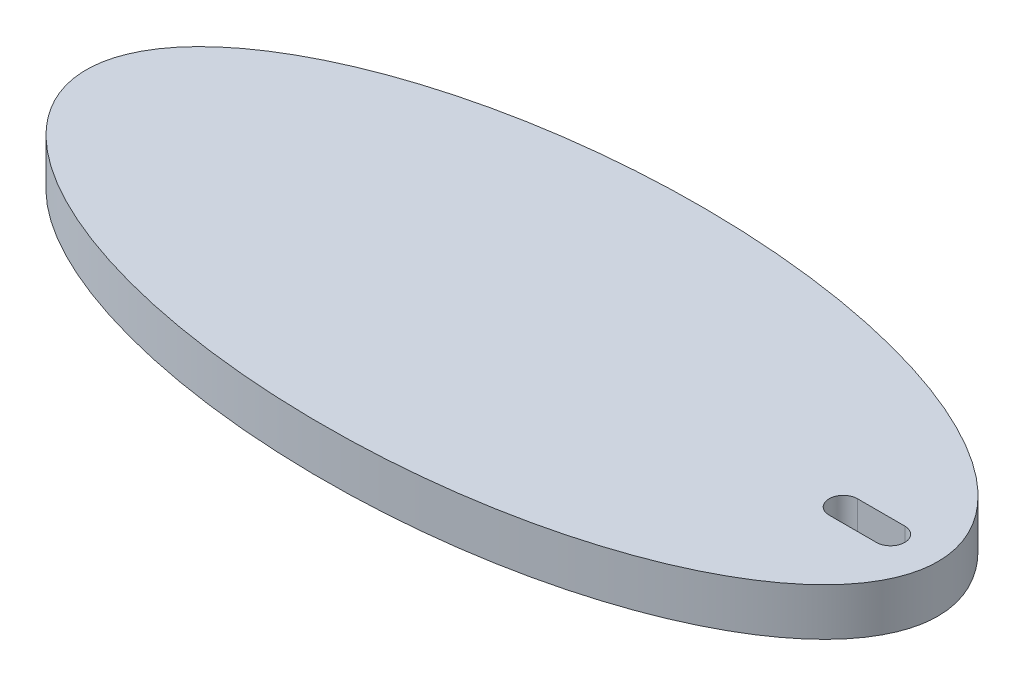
from build123d import *

# Parameters (mm, degrees)
SKETCH1_RX         = 45
SKETCH1_RY         = 20
EXTRUDE1_DEPTH     = 5
CUT_EXTRUDE1_DEPTH = 5


with BuildPart() as part:
    # Sketch1 → Extrude1 (new body)
    with BuildSketch(Plane(origin=(0, 0, 0), x_dir=(1, 0, 0), z_dir=(0, 1, 0))):
        with Locations((0, 0)):
            Ellipse(SKETCH1_RX, SKETCH1_RY)
    extrude(amount=EXTRUDE1_DEPTH)

    # Sketch2 → Cut-Extrude1 (cut)
    with BuildSketch(Plane(origin=(0, 5, 0), x_dir=(-1, 0, 0), z_dir=(0, 1, 0))):
        with BuildLine():
            Line((-35, -1.5), (-40, -1.5))
            ThreePointArc((-40, -1.5), (-41.5, 0), (-40, 1.5))
            Line((-40, 1.5), (-35, 1.5))
            ThreePointArc((-35, 1.5), (-33.5, 0), (-35, -1.5))
        make_face()
    extrude(amount=-CUT_EXTRUDE1_DEPTH, mode=Mode.SUBTRACT)


solid = part.part
